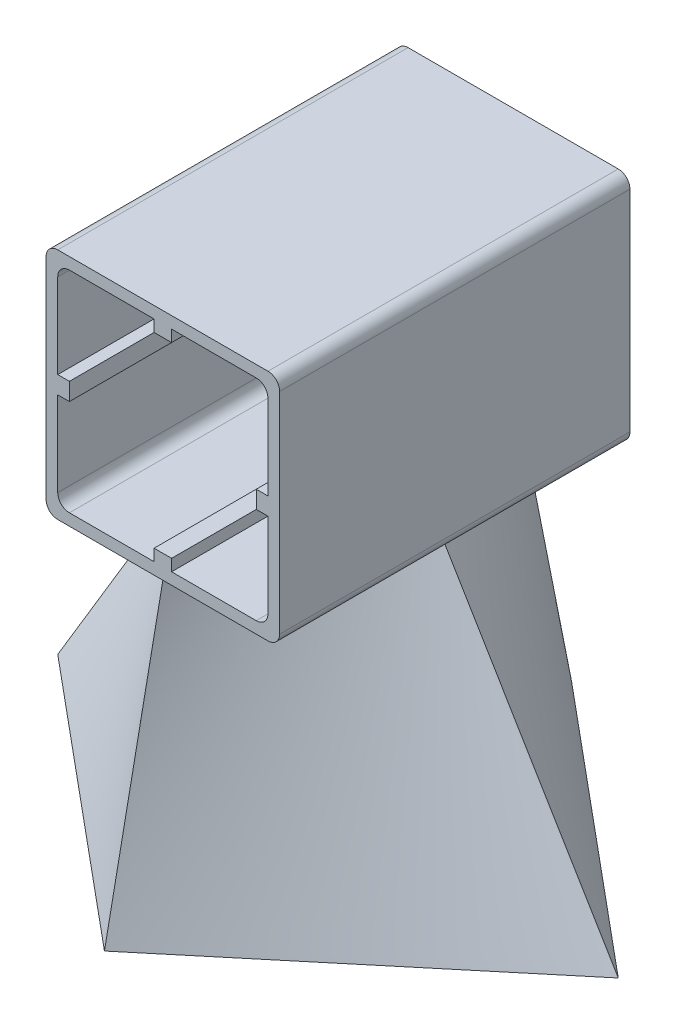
ISO-10303-21;
HEADER;
FILE_DESCRIPTION(('STEP AP214'),'2;1');
FILE_NAME('part.step','',(''),(''),'','','');
FILE_SCHEMA(('AUTOMOTIVE_DESIGN { 1 0 10303 214 1 1 1 1 }'));
ENDSEC;
DATA;
#1=APPLICATION_CONTEXT('core data for automotive mechanical design processes');
#2=APPLICATION_PROTOCOL_DEFINITION('international standard','automotive_design',2000,#1);
#3=PRODUCT_CONTEXT('',#1,'mechanical');
#4=PRODUCT('Part','Part','',(#3));
#5=PRODUCT_RELATED_PRODUCT_CATEGORY('part','',(#4));
#6=PRODUCT_DEFINITION_FORMATION('','',#4);
#7=PRODUCT_DEFINITION_CONTEXT('part definition',#1,'design');
#8=PRODUCT_DEFINITION('design','',#6,#7);
#9=PRODUCT_DEFINITION_SHAPE('','',#8);
#10=(LENGTH_UNIT() NAMED_UNIT(*) SI_UNIT(.MILLI.,.METRE.));
#11=(NAMED_UNIT(*) PLANE_ANGLE_UNIT() SI_UNIT($,.RADIAN.));
#12=(NAMED_UNIT(*) SI_UNIT($,.STERADIAN.) SOLID_ANGLE_UNIT());
#13=UNCERTAINTY_MEASURE_WITH_UNIT(LENGTH_MEASURE(1.E-05),#10,'distance_accuracy_value','');
#14=(GEOMETRIC_REPRESENTATION_CONTEXT(3) GLOBAL_UNCERTAINTY_ASSIGNED_CONTEXT((#13)) GLOBAL_UNIT_ASSIGNED_CONTEXT((#10,
#11,#12)) REPRESENTATION_CONTEXT('',''));
#15=CARTESIAN_POINT('',(0.,0.,0.));
#16=DIRECTION('',(0.,0.,1.));
#17=DIRECTION('',(1.,0.,0.));
#18=AXIS2_PLACEMENT_3D('',#15,#16,#17);
#19=CARTESIAN_POINT('',(0.,-10.,15.));
#20=DIRECTION('',(0.,-1.,0.));
#21=DIRECTION('',(0.,0.,-1.));
#22=AXIS2_PLACEMENT_3D('',#19,#20,#21);
#23=PLANE('',#22);
#24=DIRECTION('',(0.,0.,-1.));
#25=VECTOR('',#24,1.);
#26=CARTESIAN_POINT('',(-9.,-10.,15.));
#27=LINE('',#26,#25);
#28=CARTESIAN_POINT('',(-9.,-10.,15.));
#29=VERTEX_POINT('',#28);
#30=CARTESIAN_POINT('',(-9.,-10.,0.));
#31=VERTEX_POINT('',#30);
#32=EDGE_CURVE('E12',#29,#31,#27,.T.);
#33=ORIENTED_EDGE('',*,*,#32,.T.);
#34=DIRECTION('',(-0.514495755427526,0.,-0.857492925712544));
#35=VECTOR('',#34,1.);
#36=CARTESIAN_POINT('',(0.,-10.,15.));
#37=LINE('',#36,#35);
#38=CARTESIAN_POINT('',(0.,-10.,15.));
#39=VERTEX_POINT('',#38);
#40=EDGE_CURVE('E434',#39,#31,#37,.T.);
#41=ORIENTED_EDGE('',*,*,#40,.F.);
#42=DIRECTION('',(-1.,0.,0.));
#43=VECTOR('',#42,1.);
#44=CARTESIAN_POINT('',(0.,-10.,15.));
#45=LINE('',#44,#43);
#46=EDGE_CURVE('E318',#39,#29,#45,.T.);
#47=ORIENTED_EDGE('',*,*,#46,.T.);
#48=EDGE_LOOP('',(#33,#41,#47));
#49=FACE_BOUND('',#48,.T.);
#50=ADVANCED_FACE('F44',(#49),#23,.T.);
#51=CARTESIAN_POINT('',(9.,-10.,15.));
#52=VERTEX_POINT('',#51);
#53=EDGE_CURVE('E321',#52,#39,#45,.T.);
#54=ORIENTED_EDGE('',*,*,#53,.T.);
#55=DIRECTION('',(-0.514495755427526,0.,0.857492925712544));
#56=VECTOR('',#55,1.);
#57=CARTESIAN_POINT('',(9.,-10.,0.));
#58=LINE('',#57,#56);
#59=CARTESIAN_POINT('',(9.,-10.,0.));
#60=VERTEX_POINT('',#59);
#61=EDGE_CURVE('E342',#60,#39,#58,.T.);
#62=ORIENTED_EDGE('',*,*,#61,.F.);
#63=DIRECTION('',(0.,0.,-1.));
#64=VECTOR('',#63,1.);
#65=CARTESIAN_POINT('',(9.,-10.,15.));
#66=LINE('',#65,#64);
#67=EDGE_CURVE('E315',#52,#60,#66,.T.);
#68=ORIENTED_EDGE('',*,*,#67,.F.);
#69=EDGE_LOOP('',(#54,#62,#68));
#70=FACE_BOUND('',#69,.T.);
#71=ADVANCED_FACE('F443',(#70),#23,.T.);
#72=CARTESIAN_POINT('',(9.,-10.,-15.));
#73=VERTEX_POINT('',#72);
#74=EDGE_CURVE('E306',#60,#73,#66,.T.);
#75=ORIENTED_EDGE('',*,*,#74,.F.);
#76=DIRECTION('',(0.514495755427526,0.,0.857492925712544));
#77=VECTOR('',#76,1.);
#78=CARTESIAN_POINT('',(0.,-10.,-15.));
#79=LINE('',#78,#77);
#80=CARTESIAN_POINT('',(0.,-10.,-15.));
#81=VERTEX_POINT('',#80);
#82=EDGE_CURVE('E454',#81,#60,#79,.T.);
#83=ORIENTED_EDGE('',*,*,#82,.F.);
#84=DIRECTION('',(-1.,0.,0.));
#85=VECTOR('',#84,1.);
#86=CARTESIAN_POINT('',(0.,-10.,-15.));
#87=LINE('',#86,#85);
#88=EDGE_CURVE('E417',#73,#81,#87,.T.);
#89=ORIENTED_EDGE('',*,*,#88,.F.);
#90=EDGE_LOOP('',(#75,#83,#89));
#91=FACE_BOUND('',#90,.T.);
#92=ADVANCED_FACE('F769',(#91),#23,.T.);
#93=CARTESIAN_POINT('',(-9.,-10.,-15.));
#94=VERTEX_POINT('',#93);
#95=EDGE_CURVE('E409',#81,#94,#87,.T.);
#96=ORIENTED_EDGE('',*,*,#95,.F.);
#97=DIRECTION('',(0.514495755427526,0.,-0.857492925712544));
#98=VECTOR('',#97,1.);
#99=CARTESIAN_POINT('',(-9.,-10.,0.));
#100=LINE('',#99,#98);
#101=EDGE_CURVE('E1174',#31,#81,#100,.T.);
#102=ORIENTED_EDGE('',*,*,#101,.F.);
#103=EDGE_CURVE('E53',#31,#94,#27,.T.);
#104=ORIENTED_EDGE('',*,*,#103,.T.);
#105=EDGE_LOOP('',(#96,#102,#104));
#106=FACE_BOUND('',#105,.T.);
#107=ADVANCED_FACE('F765',(#106),#23,.T.);
#108=CARTESIAN_POINT('',(-9.,-9.,15.));
#109=DIRECTION('',(0.,0.,-1.));
#110=DIRECTION('',(-1.,0.,0.));
#111=AXIS2_PLACEMENT_3D('',#108,#109,#110);
#112=CYLINDRICAL_SURFACE('',#111,1.);
#113=CARTESIAN_POINT('',(-9.,-9.,-15.));
#114=DIRECTION('',(0.,0.,1.));
#115=DIRECTION('',(1.,0.,0.));
#116=AXIS2_PLACEMENT_3D('',#113,#114,#115);
#117=CIRCLE('',#116,1.);
#118=CARTESIAN_POINT('',(-10.,-9.,-15.));
#119=VERTEX_POINT('',#118);
#120=EDGE_CURVE('E406',#94,#119,#117,.F.);
#121=ORIENTED_EDGE('',*,*,#120,.F.);
#122=ORIENTED_EDGE('',*,*,#103,.F.);
#123=ORIENTED_EDGE('',*,*,#32,.F.);
#124=CARTESIAN_POINT('',(-9.,-9.,15.));
#125=DIRECTION('',(0.,0.,1.));
#126=DIRECTION('',(1.,0.,0.));
#127=AXIS2_PLACEMENT_3D('',#124,#125,#126);
#128=CIRCLE('',#127,1.);
#129=CARTESIAN_POINT('',(-10.,-9.,15.));
#130=VERTEX_POINT('',#129);
#131=EDGE_CURVE('E322',#29,#130,#128,.F.);
#132=ORIENTED_EDGE('',*,*,#131,.T.);
#133=DIRECTION('',(0.,0.,-1.));
#134=VECTOR('',#133,1.);
#135=CARTESIAN_POINT('',(-10.,-9.,15.));
#136=LINE('',#135,#134);
#137=EDGE_CURVE('E175',#130,#119,#136,.T.);
#138=ORIENTED_EDGE('',*,*,#137,.T.);
#139=EDGE_LOOP('',(#121,#122,#123,#132,#138));
#140=FACE_BOUND('',#139,.T.);
#141=ADVANCED_FACE('F430',(#140),#112,.T.);
#142=CARTESIAN_POINT('',(9.,-9.,15.));
#143=DIRECTION('',(0.,0.,-1.));
#144=DIRECTION('',(-1.,0.,0.));
#145=AXIS2_PLACEMENT_3D('',#142,#143,#144);
#146=CYLINDRICAL_SURFACE('',#145,1.);
#147=CARTESIAN_POINT('',(9.,-9.,-15.));
#148=DIRECTION('',(0.,0.,1.));
#149=DIRECTION('',(1.,0.,0.));
#150=AXIS2_PLACEMENT_3D('',#147,#148,#149);
#151=CIRCLE('',#150,1.);
#152=CARTESIAN_POINT('',(10.,-9.,-15.));
#153=VERTEX_POINT('',#152);
#154=EDGE_CURVE('E412',#153,#73,#151,.F.);
#155=ORIENTED_EDGE('',*,*,#154,.F.);
#156=DIRECTION('',(0.,0.,-1.));
#157=VECTOR('',#156,1.);
#158=CARTESIAN_POINT('',(10.,-9.,15.));
#159=LINE('',#158,#157);
#160=CARTESIAN_POINT('',(10.,-9.,15.));
#161=VERTEX_POINT('',#160);
#162=EDGE_CURVE('E304',#161,#153,#159,.T.);
#163=ORIENTED_EDGE('',*,*,#162,.F.);
#164=CARTESIAN_POINT('',(9.,-9.,15.));
#165=DIRECTION('',(0.,0.,1.));
#166=DIRECTION('',(1.,0.,0.));
#167=AXIS2_PLACEMENT_3D('',#164,#165,#166);
#168=CIRCLE('',#167,1.);
#169=EDGE_CURVE('E328',#161,#52,#168,.F.);
#170=ORIENTED_EDGE('',*,*,#169,.T.);
#171=ORIENTED_EDGE('',*,*,#67,.T.);
#172=ORIENTED_EDGE('',*,*,#74,.T.);
#173=EDGE_LOOP('',(#155,#163,#170,#171,#172));
#174=FACE_BOUND('',#173,.T.);
#175=ADVANCED_FACE('F448',(#174),#146,.T.);
#176=CARTESIAN_POINT('',(10.,0.,15.));
#177=DIRECTION('',(1.,0.,0.));
#178=DIRECTION('',(0.,0.,-1.));
#179=AXIS2_PLACEMENT_3D('',#176,#177,#178);
#180=PLANE('',#179);
#181=DIRECTION('',(0.,-1.,0.));
#182=VECTOR('',#181,1.);
#183=CARTESIAN_POINT('',(10.,0.,-15.));
#184=LINE('',#183,#182);
#185=CARTESIAN_POINT('',(10.,9.,-15.));
#186=VERTEX_POINT('',#185);
#187=EDGE_CURVE('E424',#186,#153,#184,.T.);
#188=ORIENTED_EDGE('',*,*,#187,.F.);
#189=DIRECTION('',(0.,0.,-1.));
#190=VECTOR('',#189,1.);
#191=CARTESIAN_POINT('',(10.,9.,15.));
#192=LINE('',#191,#190);
#193=CARTESIAN_POINT('',(10.,9.,15.));
#194=VERTEX_POINT('',#193);
#195=EDGE_CURVE('E298',#194,#186,#192,.T.);
#196=ORIENTED_EDGE('',*,*,#195,.F.);
#197=DIRECTION('',(0.,-1.,0.));
#198=VECTOR('',#197,1.);
#199=CARTESIAN_POINT('',(10.,0.,15.));
#200=LINE('',#199,#198);
#201=EDGE_CURVE('E332',#194,#161,#200,.T.);
#202=ORIENTED_EDGE('',*,*,#201,.T.);
#203=ORIENTED_EDGE('',*,*,#162,.T.);
#204=EDGE_LOOP('',(#188,#196,#202,#203));
#205=FACE_BOUND('',#204,.T.);
#206=ADVANCED_FACE('F784',(#205),#180,.T.);
#207=CARTESIAN_POINT('',(9.,9.,15.));
#208=DIRECTION('',(0.,0.,-1.));
#209=DIRECTION('',(-1.,0.,0.));
#210=AXIS2_PLACEMENT_3D('',#207,#208,#209);
#211=CYLINDRICAL_SURFACE('',#210,1.);
#212=CARTESIAN_POINT('',(9.,9.,-15.));
#213=DIRECTION('',(0.,0.,1.));
#214=DIRECTION('',(1.,0.,0.));
#215=AXIS2_PLACEMENT_3D('',#212,#213,#214);
#216=CIRCLE('',#215,1.);
#217=CARTESIAN_POINT('',(9.,10.,-15.));
#218=VERTEX_POINT('',#217);
#219=EDGE_CURVE('E788',#218,#186,#216,.F.);
#220=ORIENTED_EDGE('',*,*,#219,.F.);
#221=DIRECTION('',(0.,0.,-1.));
#222=VECTOR('',#221,1.);
#223=CARTESIAN_POINT('',(9.,10.,15.));
#224=LINE('',#223,#222);
#225=CARTESIAN_POINT('',(9.,10.,15.));
#226=VERTEX_POINT('',#225);
#227=EDGE_CURVE('E296',#226,#218,#224,.T.);
#228=ORIENTED_EDGE('',*,*,#227,.F.);
#229=CARTESIAN_POINT('',(9.,9.,15.));
#230=DIRECTION('',(0.,0.,1.));
#231=DIRECTION('',(1.,0.,0.));
#232=AXIS2_PLACEMENT_3D('',#229,#230,#231);
#233=CIRCLE('',#232,1.);
#234=EDGE_CURVE('E290',#226,#194,#233,.F.);
#235=ORIENTED_EDGE('',*,*,#234,.T.);
#236=ORIENTED_EDGE('',*,*,#195,.T.);
#237=EDGE_LOOP('',(#220,#228,#235,#236));
#238=FACE_BOUND('',#237,.T.);
#239=ADVANCED_FACE('F787',(#238),#211,.T.);
#240=CARTESIAN_POINT('',(0.,10.,15.));
#241=DIRECTION('',(0.,-1.,0.));
#242=DIRECTION('',(0.,0.,-1.));
#243=AXIS2_PLACEMENT_3D('',#240,#241,#242);
#244=PLANE('',#243);
#245=DIRECTION('',(-1.,0.,0.));
#246=VECTOR('',#245,1.);
#247=CARTESIAN_POINT('',(0.,10.,-15.));
#248=LINE('',#247,#246);
#249=CARTESIAN_POINT('',(-9.,10.,-15.));
#250=VERTEX_POINT('',#249);
#251=EDGE_CURVE('E295',#218,#250,#248,.T.);
#252=ORIENTED_EDGE('',*,*,#251,.T.);
#253=DIRECTION('',(0.,0.,-1.));
#254=VECTOR('',#253,1.);
#255=CARTESIAN_POINT('',(-9.,10.,15.));
#256=LINE('',#255,#254);
#257=CARTESIAN_POINT('',(-9.,10.,15.));
#258=VERTEX_POINT('',#257);
#259=EDGE_CURVE('E279',#258,#250,#256,.T.);
#260=ORIENTED_EDGE('',*,*,#259,.F.);
#261=DIRECTION('',(-1.,0.,0.));
#262=VECTOR('',#261,1.);
#263=CARTESIAN_POINT('',(0.,10.,15.));
#264=LINE('',#263,#262);
#265=EDGE_CURVE('E283',#226,#258,#264,.T.);
#266=ORIENTED_EDGE('',*,*,#265,.F.);
#267=ORIENTED_EDGE('',*,*,#227,.T.);
#268=EDGE_LOOP('',(#252,#260,#266,#267));
#269=FACE_BOUND('',#268,.T.);
#270=ADVANCED_FACE('F293',(#269),#244,.F.);
#271=CARTESIAN_POINT('',(-9.,9.,15.));
#272=DIRECTION('',(0.,0.,-1.));
#273=DIRECTION('',(-1.,0.,0.));
#274=AXIS2_PLACEMENT_3D('',#271,#272,#273);
#275=CYLINDRICAL_SURFACE('',#274,1.);
#276=CARTESIAN_POINT('',(-9.,9.,-15.));
#277=DIRECTION('',(0.,0.,1.));
#278=DIRECTION('',(1.,0.,0.));
#279=AXIS2_PLACEMENT_3D('',#276,#277,#278);
#280=CIRCLE('',#279,1.);
#281=CARTESIAN_POINT('',(-10.,9.,-15.));
#282=VERTEX_POINT('',#281);
#283=EDGE_CURVE('E789',#250,#282,#280,.T.);
#284=ORIENTED_EDGE('',*,*,#283,.T.);
#285=DIRECTION('',(0.,0.,-1.));
#286=VECTOR('',#285,1.);
#287=CARTESIAN_POINT('',(-10.,9.,15.));
#288=LINE('',#287,#286);
#289=CARTESIAN_POINT('',(-10.,9.,15.));
#290=VERTEX_POINT('',#289);
#291=EDGE_CURVE('E282',#290,#282,#288,.T.);
#292=ORIENTED_EDGE('',*,*,#291,.F.);
#293=CARTESIAN_POINT('',(-9.,9.,15.));
#294=DIRECTION('',(0.,0.,1.));
#295=DIRECTION('',(1.,0.,0.));
#296=AXIS2_PLACEMENT_3D('',#293,#294,#295);
#297=CIRCLE('',#296,1.);
#298=EDGE_CURVE('E274',#258,#290,#297,.T.);
#299=ORIENTED_EDGE('',*,*,#298,.F.);
#300=ORIENTED_EDGE('',*,*,#259,.T.);
#301=EDGE_LOOP('',(#284,#292,#299,#300));
#302=FACE_BOUND('',#301,.T.);
#303=ADVANCED_FACE('F277',(#302),#275,.T.);
#304=CARTESIAN_POINT('',(0.,-9.00000000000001,15.));
#305=DIRECTION('',(0.,-1.,0.));
#306=DIRECTION('',(0.,0.,-1.));
#307=AXIS2_PLACEMENT_3D('',#304,#305,#306);
#308=PLANE('',#307);
#309=DIRECTION('',(-1.,0.,0.));
#310=VECTOR('',#309,1.);
#311=CARTESIAN_POINT('',(0.,-9.00000000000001,-15.));
#312=LINE('',#311,#310);
#313=CARTESIAN_POINT('',(8.,-9.00000000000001,-15.));
#314=VERTEX_POINT('',#313);
#315=CARTESIAN_POINT('',(0.750000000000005,-9.00000000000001,-15.));
#316=VERTEX_POINT('',#315);
#317=EDGE_CURVE('E338',#314,#316,#312,.T.);
#318=ORIENTED_EDGE('',*,*,#317,.T.);
#319=DIRECTION('',(0.,0.,-1.));
#320=VECTOR('',#319,1.);
#321=CARTESIAN_POINT('',(0.750000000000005,-9.00000000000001,15.));
#322=LINE('',#321,#320);
#323=CARTESIAN_POINT('',(0.750000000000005,-9.00000000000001,15.));
#324=VERTEX_POINT('',#323);
#325=EDGE_CURVE('E617',#324,#316,#322,.T.);
#326=ORIENTED_EDGE('',*,*,#325,.F.);
#327=DIRECTION('',(-1.,0.,0.));
#328=VECTOR('',#327,1.);
#329=CARTESIAN_POINT('',(0.,-9.00000000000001,15.));
#330=LINE('',#329,#328);
#331=CARTESIAN_POINT('',(8.,-9.00000000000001,15.));
#332=VERTEX_POINT('',#331);
#333=EDGE_CURVE('E537',#332,#324,#330,.T.);
#334=ORIENTED_EDGE('',*,*,#333,.F.);
#335=DIRECTION('',(0.,0.,-1.));
#336=VECTOR('',#335,1.);
#337=CARTESIAN_POINT('',(8.,-9.00000000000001,15.));
#338=LINE('',#337,#336);
#339=EDGE_CURVE('E337',#332,#314,#338,.T.);
#340=ORIENTED_EDGE('',*,*,#339,.T.);
#341=EDGE_LOOP('',(#318,#326,#334,#340));
#342=FACE_BOUND('',#341,.T.);
#343=ADVANCED_FACE('F46',(#342),#308,.F.);
#344=CARTESIAN_POINT('',(0.750000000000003,0.,15.));
#345=DIRECTION('',(-1.,0.,0.));
#346=DIRECTION('',(0.,-1.,0.));
#347=AXIS2_PLACEMENT_3D('',#344,#345,#346);
#348=PLANE('',#347);
#349=DIRECTION('',(0.,1.,0.));
#350=VECTOR('',#349,1.);
#351=CARTESIAN_POINT('',(0.750000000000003,0.,-15.));
#352=LINE('',#351,#350);
#353=CARTESIAN_POINT('',(0.750000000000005,-8.,-15.));
#354=VERTEX_POINT('',#353);
#355=EDGE_CURVE('E341',#316,#354,#352,.T.);
#356=ORIENTED_EDGE('',*,*,#355,.T.);
#357=DIRECTION('',(0.,0.,-1.));
#358=VECTOR('',#357,1.);
#359=CARTESIAN_POINT('',(0.750000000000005,-8.,15.));
#360=LINE('',#359,#358);
#361=CARTESIAN_POINT('',(0.750000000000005,-8.,15.));
#362=VERTEX_POINT('',#361);
#363=EDGE_CURVE('E618',#362,#354,#360,.T.);
#364=ORIENTED_EDGE('',*,*,#363,.F.);
#365=DIRECTION('',(0.,1.,0.));
#366=VECTOR('',#365,1.);
#367=CARTESIAN_POINT('',(0.750000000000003,0.,15.));
#368=LINE('',#367,#366);
#369=EDGE_CURVE('E184',#324,#362,#368,.T.);
#370=ORIENTED_EDGE('',*,*,#369,.F.);
#371=ORIENTED_EDGE('',*,*,#325,.T.);
#372=EDGE_LOOP('',(#356,#364,#370,#371));
#373=FACE_BOUND('',#372,.T.);
#374=ADVANCED_FACE('F669',(#373),#348,.F.);
#375=CARTESIAN_POINT('',(0.,-8.,15.));
#376=DIRECTION('',(0.,1.,0.));
#377=DIRECTION('',(0.,0.,1.));
#378=AXIS2_PLACEMENT_3D('',#375,#376,#377);
#379=PLANE('',#378);
#380=DIRECTION('',(1.,0.,0.));
#381=VECTOR('',#380,1.);
#382=CARTESIAN_POINT('',(0.,-8.,-15.));
#383=LINE('',#382,#381);
#384=CARTESIAN_POINT('',(-0.749999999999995,-8.,-15.));
#385=VERTEX_POINT('',#384);
#386=EDGE_CURVE('E345',#385,#354,#383,.T.);
#387=ORIENTED_EDGE('',*,*,#386,.F.);
#388=DIRECTION('',(0.,0.,-1.));
#389=VECTOR('',#388,1.);
#390=CARTESIAN_POINT('',(-0.749999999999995,-8.,15.));
#391=LINE('',#390,#389);
#392=CARTESIAN_POINT('',(-0.749999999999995,-8.,15.));
#393=VERTEX_POINT('',#392);
#394=EDGE_CURVE('E619',#393,#385,#391,.T.);
#395=ORIENTED_EDGE('',*,*,#394,.F.);
#396=DIRECTION('',(1.,0.,0.));
#397=VECTOR('',#396,1.);
#398=CARTESIAN_POINT('',(0.,-8.,15.));
#399=LINE('',#398,#397);
#400=EDGE_CURVE('E546',#393,#362,#399,.T.);
#401=ORIENTED_EDGE('',*,*,#400,.T.);
#402=ORIENTED_EDGE('',*,*,#363,.T.);
#403=EDGE_LOOP('',(#387,#395,#401,#402));
#404=FACE_BOUND('',#403,.T.);
#405=ADVANCED_FACE('F672',(#404),#379,.T.);
#406=CARTESIAN_POINT('',(-0.749999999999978,0.,15.));
#407=DIRECTION('',(-1.,0.,0.));
#408=DIRECTION('',(0.,-1.,0.));
#409=AXIS2_PLACEMENT_3D('',#406,#407,#408);
#410=PLANE('',#409);
#411=DIRECTION('',(0.,1.,0.));
#412=VECTOR('',#411,1.);
#413=CARTESIAN_POINT('',(-0.749999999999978,0.,-15.));
#414=LINE('',#413,#412);
#415=CARTESIAN_POINT('',(-0.749999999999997,-9.00000000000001,-15.));
#416=VERTEX_POINT('',#415);
#417=EDGE_CURVE('E348',#416,#385,#414,.T.);
#418=ORIENTED_EDGE('',*,*,#417,.F.);
#419=DIRECTION('',(0.,0.,-1.));
#420=VECTOR('',#419,1.);
#421=CARTESIAN_POINT('',(-0.749999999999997,-9.00000000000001,15.));
#422=LINE('',#421,#420);
#423=CARTESIAN_POINT('',(-0.749999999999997,-9.00000000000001,15.));
#424=VERTEX_POINT('',#423);
#425=EDGE_CURVE('E623',#424,#416,#422,.T.);
#426=ORIENTED_EDGE('',*,*,#425,.F.);
#427=DIRECTION('',(0.,1.,0.));
#428=VECTOR('',#427,1.);
#429=CARTESIAN_POINT('',(-0.749999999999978,0.,15.));
#430=LINE('',#429,#428);
#431=EDGE_CURVE('E549',#424,#393,#430,.T.);
#432=ORIENTED_EDGE('',*,*,#431,.T.);
#433=ORIENTED_EDGE('',*,*,#394,.T.);
#434=EDGE_LOOP('',(#418,#426,#432,#433));
#435=FACE_BOUND('',#434,.T.);
#436=ADVANCED_FACE('F676',(#435),#410,.T.);
#437=CARTESIAN_POINT('',(0.,-9.00000000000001,15.));
#438=DIRECTION('',(0.,-1.,0.));
#439=DIRECTION('',(0.,0.,-1.));
#440=AXIS2_PLACEMENT_3D('',#437,#438,#439);
#441=PLANE('',#440);
#442=DIRECTION('',(-1.,0.,0.));
#443=VECTOR('',#442,1.);
#444=CARTESIAN_POINT('',(0.,-9.00000000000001,-15.));
#445=LINE('',#444,#443);
#446=CARTESIAN_POINT('',(-8.,-9.00000000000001,-15.));
#447=VERTEX_POINT('',#446);
#448=EDGE_CURVE('E351',#416,#447,#445,.T.);
#449=ORIENTED_EDGE('',*,*,#448,.T.);
#450=DIRECTION('',(0.,0.,-1.));
#451=VECTOR('',#450,1.);
#452=CARTESIAN_POINT('',(-8.,-9.00000000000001,15.));
#453=LINE('',#452,#451);
#454=CARTESIAN_POINT('',(-8.,-9.00000000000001,15.));
#455=VERTEX_POINT('',#454);
#456=EDGE_CURVE('E625',#455,#447,#453,.T.);
#457=ORIENTED_EDGE('',*,*,#456,.F.);
#458=DIRECTION('',(-1.,0.,0.));
#459=VECTOR('',#458,1.);
#460=CARTESIAN_POINT('',(0.,-9.00000000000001,15.));
#461=LINE('',#460,#459);
#462=EDGE_CURVE('E552',#424,#455,#461,.T.);
#463=ORIENTED_EDGE('',*,*,#462,.F.);
#464=ORIENTED_EDGE('',*,*,#425,.T.);
#465=EDGE_LOOP('',(#449,#457,#463,#464));
#466=FACE_BOUND('',#465,.T.);
#467=ADVANCED_FACE('F681',(#466),#441,.F.);
#468=CARTESIAN_POINT('',(-8.,-8.,15.));
#469=DIRECTION('',(0.,0.,-1.));
#470=DIRECTION('',(-1.,0.,0.));
#471=AXIS2_PLACEMENT_3D('',#468,#469,#470);
#472=CYLINDRICAL_SURFACE('',#471,1.);
#473=CARTESIAN_POINT('',(-8.,-8.,-15.));
#474=DIRECTION('',(0.,0.,1.));
#475=DIRECTION('',(1.,0.,0.));
#476=AXIS2_PLACEMENT_3D('',#473,#474,#475);
#477=CIRCLE('',#476,1.);
#478=CARTESIAN_POINT('',(-9.,-8.,-15.));
#479=VERTEX_POINT('',#478);
#480=EDGE_CURVE('E353',#447,#479,#477,.F.);
#481=ORIENTED_EDGE('',*,*,#480,.T.);
#482=DIRECTION('',(0.,0.,-1.));
#483=VECTOR('',#482,1.);
#484=CARTESIAN_POINT('',(-9.,-8.,15.));
#485=LINE('',#484,#483);
#486=CARTESIAN_POINT('',(-9.,-8.,15.));
#487=VERTEX_POINT('',#486);
#488=EDGE_CURVE('E628',#487,#479,#485,.T.);
#489=ORIENTED_EDGE('',*,*,#488,.F.);
#490=CARTESIAN_POINT('',(-8.,-8.,15.));
#491=DIRECTION('',(0.,0.,1.));
#492=DIRECTION('',(1.,0.,0.));
#493=AXIS2_PLACEMENT_3D('',#490,#491,#492);
#494=CIRCLE('',#493,1.);
#495=EDGE_CURVE('E554',#455,#487,#494,.F.);
#496=ORIENTED_EDGE('',*,*,#495,.F.);
#497=ORIENTED_EDGE('',*,*,#456,.T.);
#498=EDGE_LOOP('',(#481,#489,#496,#497));
#499=FACE_BOUND('',#498,.T.);
#500=ADVANCED_FACE('F686',(#499),#472,.F.);
#501=CARTESIAN_POINT('',(-9.,0.,15.));
#502=DIRECTION('',(1.,0.,0.));
#503=DIRECTION('',(0.,0.,-1.));
#504=AXIS2_PLACEMENT_3D('',#501,#502,#503);
#505=PLANE('',#504);
#506=DIRECTION('',(0.,-1.,0.));
#507=VECTOR('',#506,1.);
#508=CARTESIAN_POINT('',(-9.,0.,-15.));
#509=LINE('',#508,#507);
#510=CARTESIAN_POINT('',(-9.,-0.749999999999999,-15.));
#511=VERTEX_POINT('',#510);
#512=EDGE_CURVE('E356',#511,#479,#509,.T.);
#513=ORIENTED_EDGE('',*,*,#512,.F.);
#514=DIRECTION('',(0.,0.,-1.));
#515=VECTOR('',#514,1.);
#516=CARTESIAN_POINT('',(-9.,-0.749999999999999,15.));
#517=LINE('',#516,#515);
#518=CARTESIAN_POINT('',(-9.,-0.749999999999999,15.));
#519=VERTEX_POINT('',#518);
#520=EDGE_CURVE('E630',#519,#511,#517,.T.);
#521=ORIENTED_EDGE('',*,*,#520,.F.);
#522=DIRECTION('',(0.,-1.,0.));
#523=VECTOR('',#522,1.);
#524=CARTESIAN_POINT('',(-9.,0.,15.));
#525=LINE('',#524,#523);
#526=EDGE_CURVE('E556',#519,#487,#525,.T.);
#527=ORIENTED_EDGE('',*,*,#526,.T.);
#528=ORIENTED_EDGE('',*,*,#488,.T.);
#529=EDGE_LOOP('',(#513,#521,#527,#528));
#530=FACE_BOUND('',#529,.T.);
#531=ADVANCED_FACE('F690',(#530),#505,.T.);
#532=CARTESIAN_POINT('',(0.,-0.75000000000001,15.));
#533=DIRECTION('',(0.,1.,0.));
#534=DIRECTION('',(-1.,0.,0.));
#535=AXIS2_PLACEMENT_3D('',#532,#533,#534);
#536=PLANE('',#535);
#537=DIRECTION('',(1.,0.,0.));
#538=VECTOR('',#537,1.);
#539=CARTESIAN_POINT('',(0.,-0.75000000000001,-15.));
#540=LINE('',#539,#538);
#541=CARTESIAN_POINT('',(-8.,-0.75,-15.));
#542=VERTEX_POINT('',#541);
#543=EDGE_CURVE('E359',#511,#542,#540,.T.);
#544=ORIENTED_EDGE('',*,*,#543,.T.);
#545=DIRECTION('',(0.,0.,-1.));
#546=VECTOR('',#545,1.);
#547=CARTESIAN_POINT('',(-8.,-0.75,15.));
#548=LINE('',#547,#546);
#549=CARTESIAN_POINT('',(-8.,-0.75,15.));
#550=VERTEX_POINT('',#549);
#551=EDGE_CURVE('E632',#550,#542,#548,.T.);
#552=ORIENTED_EDGE('',*,*,#551,.F.);
#553=DIRECTION('',(1.,0.,0.));
#554=VECTOR('',#553,1.);
#555=CARTESIAN_POINT('',(0.,-0.75000000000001,15.));
#556=LINE('',#555,#554);
#557=EDGE_CURVE('E559',#519,#550,#556,.T.);
#558=ORIENTED_EDGE('',*,*,#557,.F.);
#559=ORIENTED_EDGE('',*,*,#520,.T.);
#560=EDGE_LOOP('',(#544,#552,#558,#559));
#561=FACE_BOUND('',#560,.T.);
#562=ADVANCED_FACE('F695',(#561),#536,.F.);
#563=CARTESIAN_POINT('',(-8.,0.,15.));
#564=DIRECTION('',(1.,0.,0.));
#565=DIRECTION('',(0.,0.,-1.));
#566=AXIS2_PLACEMENT_3D('',#563,#564,#565);
#567=PLANE('',#566);
#568=DIRECTION('',(0.,-1.,0.));
#569=VECTOR('',#568,1.);
#570=CARTESIAN_POINT('',(-8.,0.,-15.));
#571=LINE('',#570,#569);
#572=CARTESIAN_POINT('',(-8.,0.75,-15.));
#573=VERTEX_POINT('',#572);
#574=EDGE_CURVE('E362',#573,#542,#571,.T.);
#575=ORIENTED_EDGE('',*,*,#574,.F.);
#576=DIRECTION('',(0.,0.,-1.));
#577=VECTOR('',#576,1.);
#578=CARTESIAN_POINT('',(-8.,0.75,15.));
#579=LINE('',#578,#577);
#580=CARTESIAN_POINT('',(-8.,0.75,15.));
#581=VERTEX_POINT('',#580);
#582=EDGE_CURVE('E634',#581,#573,#579,.T.);
#583=ORIENTED_EDGE('',*,*,#582,.F.);
#584=DIRECTION('',(0.,-1.,0.));
#585=VECTOR('',#584,1.);
#586=CARTESIAN_POINT('',(-8.,0.,15.));
#587=LINE('',#586,#585);
#588=EDGE_CURVE('E561',#581,#550,#587,.T.);
#589=ORIENTED_EDGE('',*,*,#588,.T.);
#590=ORIENTED_EDGE('',*,*,#551,.T.);
#591=EDGE_LOOP('',(#575,#583,#589,#590));
#592=FACE_BOUND('',#591,.T.);
#593=ADVANCED_FACE('F878',(#592),#567,.T.);
#594=CARTESIAN_POINT('',(0.,0.750000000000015,15.));
#595=DIRECTION('',(0.,1.,0.));
#596=DIRECTION('',(-1.,0.,0.));
#597=AXIS2_PLACEMENT_3D('',#594,#595,#596);
#598=PLANE('',#597);
#599=DIRECTION('',(1.,0.,0.));
#600=VECTOR('',#599,1.);
#601=CARTESIAN_POINT('',(0.,0.750000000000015,-15.));
#602=LINE('',#601,#600);
#603=CARTESIAN_POINT('',(-9.,0.749999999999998,-15.));
#604=VERTEX_POINT('',#603);
#605=EDGE_CURVE('E365',#604,#573,#602,.T.);
#606=ORIENTED_EDGE('',*,*,#605,.F.);
#607=DIRECTION('',(0.,0.,-1.));
#608=VECTOR('',#607,1.);
#609=CARTESIAN_POINT('',(-9.,0.749999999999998,15.));
#610=LINE('',#609,#608);
#611=CARTESIAN_POINT('',(-9.,0.749999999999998,15.));
#612=VERTEX_POINT('',#611);
#613=EDGE_CURVE('E636',#612,#604,#610,.T.);
#614=ORIENTED_EDGE('',*,*,#613,.F.);
#615=DIRECTION('',(1.,0.,0.));
#616=VECTOR('',#615,1.);
#617=CARTESIAN_POINT('',(0.,0.750000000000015,15.));
#618=LINE('',#617,#616);
#619=EDGE_CURVE('E564',#612,#581,#618,.T.);
#620=ORIENTED_EDGE('',*,*,#619,.T.);
#621=ORIENTED_EDGE('',*,*,#582,.T.);
#622=EDGE_LOOP('',(#606,#614,#620,#621));
#623=FACE_BOUND('',#622,.T.);
#624=ADVANCED_FACE('F702',(#623),#598,.T.);
#625=CARTESIAN_POINT('',(-9.,0.,15.));
#626=DIRECTION('',(1.,0.,0.));
#627=DIRECTION('',(0.,0.,-1.));
#628=AXIS2_PLACEMENT_3D('',#625,#626,#627);
#629=PLANE('',#628);
#630=DIRECTION('',(0.,-1.,0.));
#631=VECTOR('',#630,1.);
#632=CARTESIAN_POINT('',(-9.,0.,-15.));
#633=LINE('',#632,#631);
#634=CARTESIAN_POINT('',(-9.,8.,-15.));
#635=VERTEX_POINT('',#634);
#636=EDGE_CURVE('E368',#635,#604,#633,.T.);
#637=ORIENTED_EDGE('',*,*,#636,.F.);
#638=DIRECTION('',(0.,0.,-1.));
#639=VECTOR('',#638,1.);
#640=CARTESIAN_POINT('',(-9.,8.,15.));
#641=LINE('',#640,#639);
#642=CARTESIAN_POINT('',(-9.,8.,15.));
#643=VERTEX_POINT('',#642);
#644=EDGE_CURVE('E638',#643,#635,#641,.T.);
#645=ORIENTED_EDGE('',*,*,#644,.F.);
#646=DIRECTION('',(0.,-1.,0.));
#647=VECTOR('',#646,1.);
#648=CARTESIAN_POINT('',(-9.,0.,15.));
#649=LINE('',#648,#647);
#650=EDGE_CURVE('E567',#643,#612,#649,.T.);
#651=ORIENTED_EDGE('',*,*,#650,.T.);
#652=ORIENTED_EDGE('',*,*,#613,.T.);
#653=EDGE_LOOP('',(#637,#645,#651,#652));
#654=FACE_BOUND('',#653,.T.);
#655=ADVANCED_FACE('F706',(#654),#629,.T.);
#656=CARTESIAN_POINT('',(-8.,8.,15.));
#657=DIRECTION('',(0.,0.,-1.));
#658=DIRECTION('',(-1.,0.,0.));
#659=AXIS2_PLACEMENT_3D('',#656,#657,#658);
#660=CYLINDRICAL_SURFACE('',#659,0.999999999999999);
#661=CARTESIAN_POINT('',(-8.,8.,-15.));
#662=DIRECTION('',(0.,0.,1.));
#663=DIRECTION('',(1.,0.,0.));
#664=AXIS2_PLACEMENT_3D('',#661,#662,#663);
#665=CIRCLE('',#664,0.999999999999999);
#666=CARTESIAN_POINT('',(-8.,9.,-15.));
#667=VERTEX_POINT('',#666);
#668=EDGE_CURVE('E371',#667,#635,#665,.T.);
#669=ORIENTED_EDGE('',*,*,#668,.F.);
#670=DIRECTION('',(0.,0.,-1.));
#671=VECTOR('',#670,1.);
#672=CARTESIAN_POINT('',(-8.,9.,15.));
#673=LINE('',#672,#671);
#674=CARTESIAN_POINT('',(-8.,9.,15.));
#675=VERTEX_POINT('',#674);
#676=EDGE_CURVE('E640',#675,#667,#673,.T.);
#677=ORIENTED_EDGE('',*,*,#676,.F.);
#678=CARTESIAN_POINT('',(-8.,8.,15.));
#679=DIRECTION('',(0.,0.,1.));
#680=DIRECTION('',(1.,0.,0.));
#681=AXIS2_PLACEMENT_3D('',#678,#679,#680);
#682=CIRCLE('',#681,0.999999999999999);
#683=EDGE_CURVE('E570',#675,#643,#682,.T.);
#684=ORIENTED_EDGE('',*,*,#683,.T.);
#685=ORIENTED_EDGE('',*,*,#644,.T.);
#686=EDGE_LOOP('',(#669,#677,#684,#685));
#687=FACE_BOUND('',#686,.T.);
#688=ADVANCED_FACE('F711',(#687),#660,.F.);
#689=CARTESIAN_POINT('',(0.,9.,15.));
#690=DIRECTION('',(0.,-1.,0.));
#691=DIRECTION('',(0.,0.,-1.));
#692=AXIS2_PLACEMENT_3D('',#689,#690,#691);
#693=PLANE('',#692);
#694=DIRECTION('',(-1.,0.,0.));
#695=VECTOR('',#694,1.);
#696=CARTESIAN_POINT('',(0.,9.,-15.));
#697=LINE('',#696,#695);
#698=CARTESIAN_POINT('',(-0.750000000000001,9.,-15.));
#699=VERTEX_POINT('',#698);
#700=EDGE_CURVE('E374',#699,#667,#697,.T.);
#701=ORIENTED_EDGE('',*,*,#700,.F.);
#702=DIRECTION('',(0.,0.,-1.));
#703=VECTOR('',#702,1.);
#704=CARTESIAN_POINT('',(-0.750000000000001,9.,15.));
#705=LINE('',#704,#703);
#706=CARTESIAN_POINT('',(-0.750000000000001,9.,15.));
#707=VERTEX_POINT('',#706);
#708=EDGE_CURVE('E642',#707,#699,#705,.T.);
#709=ORIENTED_EDGE('',*,*,#708,.F.);
#710=DIRECTION('',(-1.,0.,0.));
#711=VECTOR('',#710,1.);
#712=CARTESIAN_POINT('',(0.,9.,15.));
#713=LINE('',#712,#711);
#714=EDGE_CURVE('E573',#707,#675,#713,.T.);
#715=ORIENTED_EDGE('',*,*,#714,.T.);
#716=ORIENTED_EDGE('',*,*,#676,.T.);
#717=EDGE_LOOP('',(#701,#709,#715,#716));
#718=FACE_BOUND('',#717,.T.);
#719=ADVANCED_FACE('F714',(#718),#693,.T.);
#720=CARTESIAN_POINT('',(-0.750000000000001,0.,15.));
#721=DIRECTION('',(1.,0.,0.));
#722=DIRECTION('',(0.,0.,-1.));
#723=AXIS2_PLACEMENT_3D('',#720,#721,#722);
#724=PLANE('',#723);
#725=DIRECTION('',(0.,-1.,0.));
#726=VECTOR('',#725,1.);
#727=CARTESIAN_POINT('',(-0.750000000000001,0.,-15.));
#728=LINE('',#727,#726);
#729=CARTESIAN_POINT('',(-0.750000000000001,8.,-15.));
#730=VERTEX_POINT('',#729);
#731=EDGE_CURVE('E377',#699,#730,#728,.T.);
#732=ORIENTED_EDGE('',*,*,#731,.T.);
#733=DIRECTION('',(0.,0.,-1.));
#734=VECTOR('',#733,1.);
#735=CARTESIAN_POINT('',(-0.750000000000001,8.,15.));
#736=LINE('',#735,#734);
#737=CARTESIAN_POINT('',(-0.750000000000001,8.,15.));
#738=VERTEX_POINT('',#737);
#739=EDGE_CURVE('E644',#738,#730,#736,.T.);
#740=ORIENTED_EDGE('',*,*,#739,.F.);
#741=DIRECTION('',(0.,-1.,0.));
#742=VECTOR('',#741,1.);
#743=CARTESIAN_POINT('',(-0.750000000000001,0.,15.));
#744=LINE('',#743,#742);
#745=EDGE_CURVE('E576',#707,#738,#744,.T.);
#746=ORIENTED_EDGE('',*,*,#745,.F.);
#747=ORIENTED_EDGE('',*,*,#708,.T.);
#748=EDGE_LOOP('',(#732,#740,#746,#747));
#749=FACE_BOUND('',#748,.T.);
#750=ADVANCED_FACE('F720',(#749),#724,.F.);
#751=CARTESIAN_POINT('',(0.,8.,15.));
#752=DIRECTION('',(0.,-1.,0.));
#753=DIRECTION('',(0.,0.,-1.));
#754=AXIS2_PLACEMENT_3D('',#751,#752,#753);
#755=PLANE('',#754);
#756=DIRECTION('',(-1.,0.,0.));
#757=VECTOR('',#756,1.);
#758=CARTESIAN_POINT('',(0.,8.,-15.));
#759=LINE('',#758,#757);
#760=CARTESIAN_POINT('',(0.749999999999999,8.,-15.));
#761=VERTEX_POINT('',#760);
#762=EDGE_CURVE('E380',#761,#730,#759,.T.);
#763=ORIENTED_EDGE('',*,*,#762,.F.);
#764=DIRECTION('',(0.,0.,-1.));
#765=VECTOR('',#764,1.);
#766=CARTESIAN_POINT('',(0.749999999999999,8.,15.));
#767=LINE('',#766,#765);
#768=CARTESIAN_POINT('',(0.749999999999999,8.,15.));
#769=VERTEX_POINT('',#768);
#770=EDGE_CURVE('E646',#769,#761,#767,.T.);
#771=ORIENTED_EDGE('',*,*,#770,.F.);
#772=DIRECTION('',(-1.,0.,0.));
#773=VECTOR('',#772,1.);
#774=CARTESIAN_POINT('',(0.,8.,15.));
#775=LINE('',#774,#773);
#776=EDGE_CURVE('E578',#769,#738,#775,.T.);
#777=ORIENTED_EDGE('',*,*,#776,.T.);
#778=ORIENTED_EDGE('',*,*,#739,.T.);
#779=EDGE_LOOP('',(#763,#771,#777,#778));
#780=FACE_BOUND('',#779,.T.);
#781=ADVANCED_FACE('F724',(#780),#755,.T.);
#782=CARTESIAN_POINT('',(0.74999999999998,0.,15.));
#783=DIRECTION('',(1.,0.,0.));
#784=DIRECTION('',(0.,1.,0.));
#785=AXIS2_PLACEMENT_3D('',#782,#783,#784);
#786=PLANE('',#785);
#787=DIRECTION('',(0.,-1.,0.));
#788=VECTOR('',#787,1.);
#789=CARTESIAN_POINT('',(0.74999999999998,0.,-15.));
#790=LINE('',#789,#788);
#791=CARTESIAN_POINT('',(0.750000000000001,9.,-15.));
#792=VERTEX_POINT('',#791);
#793=EDGE_CURVE('E383',#792,#761,#790,.T.);
#794=ORIENTED_EDGE('',*,*,#793,.F.);
#795=DIRECTION('',(0.,0.,-1.));
#796=VECTOR('',#795,1.);
#797=CARTESIAN_POINT('',(0.750000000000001,9.,15.));
#798=LINE('',#797,#796);
#799=CARTESIAN_POINT('',(0.750000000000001,9.,15.));
#800=VERTEX_POINT('',#799);
#801=EDGE_CURVE('E648',#800,#792,#798,.T.);
#802=ORIENTED_EDGE('',*,*,#801,.F.);
#803=DIRECTION('',(0.,-1.,0.));
#804=VECTOR('',#803,1.);
#805=CARTESIAN_POINT('',(0.74999999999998,0.,15.));
#806=LINE('',#805,#804);
#807=EDGE_CURVE('E581',#800,#769,#806,.T.);
#808=ORIENTED_EDGE('',*,*,#807,.T.);
#809=ORIENTED_EDGE('',*,*,#770,.T.);
#810=EDGE_LOOP('',(#794,#802,#808,#809));
#811=FACE_BOUND('',#810,.T.);
#812=ADVANCED_FACE('F727',(#811),#786,.T.);
#813=CARTESIAN_POINT('',(0.,9.,15.));
#814=DIRECTION('',(0.,-1.,0.));
#815=DIRECTION('',(0.,0.,-1.));
#816=AXIS2_PLACEMENT_3D('',#813,#814,#815);
#817=PLANE('',#816);
#818=DIRECTION('',(-1.,0.,0.));
#819=VECTOR('',#818,1.);
#820=CARTESIAN_POINT('',(0.,9.,-15.));
#821=LINE('',#820,#819);
#822=CARTESIAN_POINT('',(8.,9.,-15.));
#823=VERTEX_POINT('',#822);
#824=EDGE_CURVE('E386',#823,#792,#821,.T.);
#825=ORIENTED_EDGE('',*,*,#824,.F.);
#826=DIRECTION('',(0.,0.,-1.));
#827=VECTOR('',#826,1.);
#828=CARTESIAN_POINT('',(8.,9.,15.));
#829=LINE('',#828,#827);
#830=CARTESIAN_POINT('',(8.,9.,15.));
#831=VERTEX_POINT('',#830);
#832=EDGE_CURVE('E650',#831,#823,#829,.T.);
#833=ORIENTED_EDGE('',*,*,#832,.F.);
#834=DIRECTION('',(-1.,0.,0.));
#835=VECTOR('',#834,1.);
#836=CARTESIAN_POINT('',(0.,9.,15.));
#837=LINE('',#836,#835);
#838=EDGE_CURVE('E584',#831,#800,#837,.T.);
#839=ORIENTED_EDGE('',*,*,#838,.T.);
#840=ORIENTED_EDGE('',*,*,#801,.T.);
#841=EDGE_LOOP('',(#825,#833,#839,#840));
#842=FACE_BOUND('',#841,.T.);
#843=ADVANCED_FACE('F731',(#842),#817,.T.);
#844=CARTESIAN_POINT('',(8.,8.,15.));
#845=DIRECTION('',(0.,0.,-1.));
#846=DIRECTION('',(-1.,0.,0.));
#847=AXIS2_PLACEMENT_3D('',#844,#845,#846);
#848=CYLINDRICAL_SURFACE('',#847,0.999999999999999);
#849=CARTESIAN_POINT('',(8.,8.,-15.));
#850=DIRECTION('',(0.,0.,1.));
#851=DIRECTION('',(1.,0.,0.));
#852=AXIS2_PLACEMENT_3D('',#849,#850,#851);
#853=CIRCLE('',#852,0.999999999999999);
#854=CARTESIAN_POINT('',(9.,8.,-15.));
#855=VERTEX_POINT('',#854);
#856=EDGE_CURVE('E389',#823,#855,#853,.F.);
#857=ORIENTED_EDGE('',*,*,#856,.T.);
#858=DIRECTION('',(0.,0.,-1.));
#859=VECTOR('',#858,1.);
#860=CARTESIAN_POINT('',(9.,8.,15.));
#861=LINE('',#860,#859);
#862=CARTESIAN_POINT('',(9.,8.,15.));
#863=VERTEX_POINT('',#862);
#864=EDGE_CURVE('E652',#863,#855,#861,.T.);
#865=ORIENTED_EDGE('',*,*,#864,.F.);
#866=CARTESIAN_POINT('',(8.,8.,15.));
#867=DIRECTION('',(0.,0.,1.));
#868=DIRECTION('',(1.,0.,0.));
#869=AXIS2_PLACEMENT_3D('',#866,#867,#868);
#870=CIRCLE('',#869,0.999999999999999);
#871=EDGE_CURVE('E587',#831,#863,#870,.F.);
#872=ORIENTED_EDGE('',*,*,#871,.F.);
#873=ORIENTED_EDGE('',*,*,#832,.T.);
#874=EDGE_LOOP('',(#857,#865,#872,#873));
#875=FACE_BOUND('',#874,.T.);
#876=ADVANCED_FACE('F736',(#875),#848,.F.);
#877=CARTESIAN_POINT('',(9.,0.,15.));
#878=DIRECTION('',(1.,0.,0.));
#879=DIRECTION('',(0.,0.,-1.));
#880=AXIS2_PLACEMENT_3D('',#877,#878,#879);
#881=PLANE('',#880);
#882=DIRECTION('',(0.,-1.,0.));
#883=VECTOR('',#882,1.);
#884=CARTESIAN_POINT('',(9.,0.,-15.));
#885=LINE('',#884,#883);
#886=CARTESIAN_POINT('',(9.,0.750000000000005,-15.));
#887=VERTEX_POINT('',#886);
#888=EDGE_CURVE('E391',#855,#887,#885,.T.);
#889=ORIENTED_EDGE('',*,*,#888,.T.);
#890=DIRECTION('',(0.,0.,-1.));
#891=VECTOR('',#890,1.);
#892=CARTESIAN_POINT('',(9.,0.750000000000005,15.));
#893=LINE('',#892,#891);
#894=CARTESIAN_POINT('',(9.,0.750000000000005,15.));
#895=VERTEX_POINT('',#894);
#896=EDGE_CURVE('E655',#895,#887,#893,.T.);
#897=ORIENTED_EDGE('',*,*,#896,.F.);
#898=DIRECTION('',(0.,-1.,0.));
#899=VECTOR('',#898,1.);
#900=CARTESIAN_POINT('',(9.,0.,15.));
#901=LINE('',#900,#899);
#902=EDGE_CURVE('E589',#863,#895,#901,.T.);
#903=ORIENTED_EDGE('',*,*,#902,.F.);
#904=ORIENTED_EDGE('',*,*,#864,.T.);
#905=EDGE_LOOP('',(#889,#897,#903,#904));
#906=FACE_BOUND('',#905,.T.);
#907=ADVANCED_FACE('F743',(#906),#881,.F.);
#908=CARTESIAN_POINT('',(0.,0.750000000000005,15.));
#909=DIRECTION('',(0.,-1.,0.));
#910=DIRECTION('',(0.,0.,-1.));
#911=AXIS2_PLACEMENT_3D('',#908,#909,#910);
#912=PLANE('',#911);
#913=DIRECTION('',(-1.,0.,0.));
#914=VECTOR('',#913,1.);
#915=CARTESIAN_POINT('',(0.,0.750000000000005,-15.));
#916=LINE('',#915,#914);
#917=CARTESIAN_POINT('',(8.,0.750000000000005,-15.));
#918=VERTEX_POINT('',#917);
#919=EDGE_CURVE('E393',#887,#918,#916,.T.);
#920=ORIENTED_EDGE('',*,*,#919,.T.);
#921=DIRECTION('',(0.,0.,-1.));
#922=VECTOR('',#921,1.);
#923=CARTESIAN_POINT('',(8.,0.750000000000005,15.));
#924=LINE('',#923,#922);
#925=CARTESIAN_POINT('',(8.,0.750000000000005,15.));
#926=VERTEX_POINT('',#925);
#927=EDGE_CURVE('E658',#926,#918,#924,.T.);
#928=ORIENTED_EDGE('',*,*,#927,.F.);
#929=DIRECTION('',(-1.,0.,0.));
#930=VECTOR('',#929,1.);
#931=CARTESIAN_POINT('',(0.,0.750000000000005,15.));
#932=LINE('',#931,#930);
#933=EDGE_CURVE('E591',#895,#926,#932,.T.);
#934=ORIENTED_EDGE('',*,*,#933,.F.);
#935=ORIENTED_EDGE('',*,*,#896,.T.);
#936=EDGE_LOOP('',(#920,#928,#934,#935));
#937=FACE_BOUND('',#936,.T.);
#938=ADVANCED_FACE('F747',(#937),#912,.F.);
#939=CARTESIAN_POINT('',(8.,0.,15.));
#940=DIRECTION('',(-1.,0.,0.));
#941=DIRECTION('',(0.,0.,1.));
#942=AXIS2_PLACEMENT_3D('',#939,#940,#941);
#943=PLANE('',#942);
#944=DIRECTION('',(0.,1.,0.));
#945=VECTOR('',#944,1.);
#946=CARTESIAN_POINT('',(8.,0.,-15.));
#947=LINE('',#946,#945);
#948=CARTESIAN_POINT('',(8.,-0.749999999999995,-15.));
#949=VERTEX_POINT('',#948);
#950=EDGE_CURVE('E396',#949,#918,#947,.T.);
#951=ORIENTED_EDGE('',*,*,#950,.F.);
#952=DIRECTION('',(0.,0.,-1.));
#953=VECTOR('',#952,1.);
#954=CARTESIAN_POINT('',(8.,-0.749999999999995,15.));
#955=LINE('',#954,#953);
#956=CARTESIAN_POINT('',(8.,-0.749999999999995,15.));
#957=VERTEX_POINT('',#956);
#958=EDGE_CURVE('E660',#957,#949,#955,.T.);
#959=ORIENTED_EDGE('',*,*,#958,.F.);
#960=DIRECTION('',(0.,1.,0.));
#961=VECTOR('',#960,1.);
#962=CARTESIAN_POINT('',(8.,0.,15.));
#963=LINE('',#962,#961);
#964=EDGE_CURVE('E593',#957,#926,#963,.T.);
#965=ORIENTED_EDGE('',*,*,#964,.T.);
#966=ORIENTED_EDGE('',*,*,#927,.T.);
#967=EDGE_LOOP('',(#951,#959,#965,#966));
#968=FACE_BOUND('',#967,.T.);
#969=ADVANCED_FACE('F750',(#968),#943,.T.);
#970=CARTESIAN_POINT('',(0.,-0.749999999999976,15.));
#971=DIRECTION('',(0.,-1.,0.));
#972=DIRECTION('',(1.,0.,0.));
#973=AXIS2_PLACEMENT_3D('',#970,#971,#972);
#974=PLANE('',#973);
#975=DIRECTION('',(-1.,0.,0.));
#976=VECTOR('',#975,1.);
#977=CARTESIAN_POINT('',(0.,-0.749999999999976,-15.));
#978=LINE('',#977,#976);
#979=CARTESIAN_POINT('',(9.,-0.749999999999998,-15.));
#980=VERTEX_POINT('',#979);
#981=EDGE_CURVE('E399',#980,#949,#978,.T.);
#982=ORIENTED_EDGE('',*,*,#981,.F.);
#983=DIRECTION('',(0.,0.,-1.));
#984=VECTOR('',#983,1.);
#985=CARTESIAN_POINT('',(9.,-0.749999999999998,15.));
#986=LINE('',#985,#984);
#987=CARTESIAN_POINT('',(9.,-0.749999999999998,15.));
#988=VERTEX_POINT('',#987);
#989=EDGE_CURVE('E662',#988,#980,#986,.T.);
#990=ORIENTED_EDGE('',*,*,#989,.F.);
#991=DIRECTION('',(-1.,0.,0.));
#992=VECTOR('',#991,1.);
#993=CARTESIAN_POINT('',(0.,-0.749999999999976,15.));
#994=LINE('',#993,#992);
#995=EDGE_CURVE('E596',#988,#957,#994,.T.);
#996=ORIENTED_EDGE('',*,*,#995,.T.);
#997=ORIENTED_EDGE('',*,*,#958,.T.);
#998=EDGE_LOOP('',(#982,#990,#996,#997));
#999=FACE_BOUND('',#998,.T.);
#1000=ADVANCED_FACE('F752',(#999),#974,.T.);
#1001=CARTESIAN_POINT('',(9.,0.,15.));
#1002=DIRECTION('',(1.,0.,0.));
#1003=DIRECTION('',(0.,0.,-1.));
#1004=AXIS2_PLACEMENT_3D('',#1001,#1002,#1003);
#1005=PLANE('',#1004);
#1006=DIRECTION('',(0.,-1.,0.));
#1007=VECTOR('',#1006,1.);
#1008=CARTESIAN_POINT('',(9.,0.,-15.));
#1009=LINE('',#1008,#1007);
#1010=CARTESIAN_POINT('',(9.,-8.,-15.));
#1011=VERTEX_POINT('',#1010);
#1012=EDGE_CURVE('E402',#980,#1011,#1009,.T.);
#1013=ORIENTED_EDGE('',*,*,#1012,.T.);
#1014=DIRECTION('',(0.,0.,-1.));
#1015=VECTOR('',#1014,1.);
#1016=CARTESIAN_POINT('',(9.,-8.,15.));
#1017=LINE('',#1016,#1015);
#1018=CARTESIAN_POINT('',(9.,-8.,15.));
#1019=VERTEX_POINT('',#1018);
#1020=EDGE_CURVE('E616',#1019,#1011,#1017,.T.);
#1021=ORIENTED_EDGE('',*,*,#1020,.F.);
#1022=DIRECTION('',(0.,-1.,0.));
#1023=VECTOR('',#1022,1.);
#1024=CARTESIAN_POINT('',(9.,0.,15.));
#1025=LINE('',#1024,#1023);
#1026=EDGE_CURVE('E599',#988,#1019,#1025,.T.);
#1027=ORIENTED_EDGE('',*,*,#1026,.F.);
#1028=ORIENTED_EDGE('',*,*,#989,.T.);
#1029=EDGE_LOOP('',(#1013,#1021,#1027,#1028));
#1030=FACE_BOUND('',#1029,.T.);
#1031=ADVANCED_FACE('F753',(#1030),#1005,.F.);
#1032=CARTESIAN_POINT('',(8.,-8.,15.));
#1033=DIRECTION('',(0.,0.,-1.));
#1034=DIRECTION('',(-1.,0.,0.));
#1035=AXIS2_PLACEMENT_3D('',#1032,#1033,#1034);
#1036=CYLINDRICAL_SURFACE('',#1035,1.);
#1037=CARTESIAN_POINT('',(8.,-8.,-15.));
#1038=DIRECTION('',(0.,0.,1.));
#1039=DIRECTION('',(1.,0.,0.));
#1040=AXIS2_PLACEMENT_3D('',#1037,#1038,#1039);
#1041=CIRCLE('',#1040,1.);
#1042=EDGE_CURVE('E404',#1011,#314,#1041,.F.);
#1043=ORIENTED_EDGE('',*,*,#1042,.T.);
#1044=ORIENTED_EDGE('',*,*,#339,.F.);
#1045=CARTESIAN_POINT('',(8.,-8.,15.));
#1046=DIRECTION('',(0.,0.,1.));
#1047=DIRECTION('',(1.,0.,0.));
#1048=AXIS2_PLACEMENT_3D('',#1045,#1046,#1047);
#1049=CIRCLE('',#1048,1.);
#1050=EDGE_CURVE('E600',#1019,#332,#1049,.F.);
#1051=ORIENTED_EDGE('',*,*,#1050,.F.);
#1052=ORIENTED_EDGE('',*,*,#1020,.T.);
#1053=EDGE_LOOP('',(#1043,#1044,#1051,#1052));
#1054=FACE_BOUND('',#1053,.T.);
#1055=ADVANCED_FACE('F612',(#1054),#1036,.F.);
#1056=CARTESIAN_POINT('',(-10.,0.,15.));
#1057=DIRECTION('',(1.,0.,0.));
#1058=DIRECTION('',(0.,0.,-1.));
#1059=AXIS2_PLACEMENT_3D('',#1056,#1057,#1058);
#1060=PLANE('',#1059);
#1061=DIRECTION('',(0.,-1.,0.));
#1062=VECTOR('',#1061,1.);
#1063=CARTESIAN_POINT('',(-10.,0.,-15.));
#1064=LINE('',#1063,#1062);
#1065=EDGE_CURVE('E544',#282,#119,#1064,.T.);
#1066=ORIENTED_EDGE('',*,*,#1065,.T.);
#1067=ORIENTED_EDGE('',*,*,#137,.F.);
#1068=DIRECTION('',(0.,-1.,0.));
#1069=VECTOR('',#1068,1.);
#1070=CARTESIAN_POINT('',(-10.,0.,15.));
#1071=LINE('',#1070,#1069);
#1072=EDGE_CURVE('E70',#290,#130,#1071,.T.);
#1073=ORIENTED_EDGE('',*,*,#1072,.F.);
#1074=ORIENTED_EDGE('',*,*,#291,.T.);
#1075=EDGE_LOOP('',(#1066,#1067,#1073,#1074));
#1076=FACE_BOUND('',#1075,.T.);
#1077=ADVANCED_FACE('F760',(#1076),#1060,.F.);
#1078=CARTESIAN_POINT('',(0.,0.,15.));
#1079=DIRECTION('',(0.,0.,1.));
#1080=DIRECTION('',(1.,0.,0.));
#1081=AXIS2_PLACEMENT_3D('',#1078,#1079,#1080);
#1082=PLANE('',#1081);
#1083=ORIENTED_EDGE('',*,*,#333,.T.);
#1084=ORIENTED_EDGE('',*,*,#369,.T.);
#1085=ORIENTED_EDGE('',*,*,#400,.F.);
#1086=ORIENTED_EDGE('',*,*,#431,.F.);
#1087=ORIENTED_EDGE('',*,*,#462,.T.);
#1088=ORIENTED_EDGE('',*,*,#495,.T.);
#1089=ORIENTED_EDGE('',*,*,#526,.F.);
#1090=ORIENTED_EDGE('',*,*,#557,.T.);
#1091=ORIENTED_EDGE('',*,*,#588,.F.);
#1092=ORIENTED_EDGE('',*,*,#619,.F.);
#1093=ORIENTED_EDGE('',*,*,#650,.F.);
#1094=ORIENTED_EDGE('',*,*,#683,.F.);
#1095=ORIENTED_EDGE('',*,*,#714,.F.);
#1096=ORIENTED_EDGE('',*,*,#745,.T.);
#1097=ORIENTED_EDGE('',*,*,#776,.F.);
#1098=ORIENTED_EDGE('',*,*,#807,.F.);
#1099=ORIENTED_EDGE('',*,*,#838,.F.);
#1100=ORIENTED_EDGE('',*,*,#871,.T.);
#1101=ORIENTED_EDGE('',*,*,#902,.T.);
#1102=ORIENTED_EDGE('',*,*,#933,.T.);
#1103=ORIENTED_EDGE('',*,*,#964,.F.);
#1104=ORIENTED_EDGE('',*,*,#995,.F.);
#1105=ORIENTED_EDGE('',*,*,#1026,.T.);
#1106=ORIENTED_EDGE('',*,*,#1050,.T.);
#1107=EDGE_LOOP('',(#1083,#1084,#1085,#1086,#1087,#1088,#1089,#1090,#1091,#1092,#1093,#1094,
#1095,#1096,#1097,#1098,#1099,#1100,#1101,#1102,#1103,#1104,#1105,#1106));
#1108=FACE_BOUND('',#1107,.T.);
#1109=ORIENTED_EDGE('',*,*,#131,.F.);
#1110=ORIENTED_EDGE('',*,*,#46,.F.);
#1111=ORIENTED_EDGE('',*,*,#53,.F.);
#1112=ORIENTED_EDGE('',*,*,#169,.F.);
#1113=ORIENTED_EDGE('',*,*,#201,.F.);
#1114=ORIENTED_EDGE('',*,*,#234,.F.);
#1115=ORIENTED_EDGE('',*,*,#265,.T.);
#1116=ORIENTED_EDGE('',*,*,#298,.T.);
#1117=ORIENTED_EDGE('',*,*,#1072,.T.);
#1118=EDGE_LOOP('',(#1109,#1110,#1111,#1112,#1113,#1114,#1115,#1116,#1117));
#1119=FACE_BOUND('',#1118,.T.);
#1120=ADVANCED_FACE('F287',(#1108,#1119),#1082,.T.);
#1121=CARTESIAN_POINT('',(0.,0.,-15.));
#1122=DIRECTION('',(0.,0.,1.));
#1123=DIRECTION('',(1.,0.,0.));
#1124=AXIS2_PLACEMENT_3D('',#1121,#1122,#1123);
#1125=PLANE('',#1124);
#1126=ORIENTED_EDGE('',*,*,#317,.F.);
#1127=ORIENTED_EDGE('',*,*,#1042,.F.);
#1128=ORIENTED_EDGE('',*,*,#1012,.F.);
#1129=ORIENTED_EDGE('',*,*,#981,.T.);
#1130=ORIENTED_EDGE('',*,*,#950,.T.);
#1131=ORIENTED_EDGE('',*,*,#919,.F.);
#1132=ORIENTED_EDGE('',*,*,#888,.F.);
#1133=ORIENTED_EDGE('',*,*,#856,.F.);
#1134=ORIENTED_EDGE('',*,*,#824,.T.);
#1135=ORIENTED_EDGE('',*,*,#793,.T.);
#1136=ORIENTED_EDGE('',*,*,#762,.T.);
#1137=ORIENTED_EDGE('',*,*,#731,.F.);
#1138=ORIENTED_EDGE('',*,*,#700,.T.);
#1139=ORIENTED_EDGE('',*,*,#668,.T.);
#1140=ORIENTED_EDGE('',*,*,#636,.T.);
#1141=ORIENTED_EDGE('',*,*,#605,.T.);
#1142=ORIENTED_EDGE('',*,*,#574,.T.);
#1143=ORIENTED_EDGE('',*,*,#543,.F.);
#1144=ORIENTED_EDGE('',*,*,#512,.T.);
#1145=ORIENTED_EDGE('',*,*,#480,.F.);
#1146=ORIENTED_EDGE('',*,*,#448,.F.);
#1147=ORIENTED_EDGE('',*,*,#417,.T.);
#1148=ORIENTED_EDGE('',*,*,#386,.T.);
#1149=ORIENTED_EDGE('',*,*,#355,.F.);
#1150=EDGE_LOOP('',(#1126,#1127,#1128,#1129,#1130,#1131,#1132,#1133,#1134,#1135,#1136,#1137,
#1138,#1139,#1140,#1141,#1142,#1143,#1144,#1145,#1146,#1147,#1148,#1149));
#1151=FACE_BOUND('',#1150,.T.);
#1152=ORIENTED_EDGE('',*,*,#120,.T.);
#1153=ORIENTED_EDGE('',*,*,#1065,.F.);
#1154=ORIENTED_EDGE('',*,*,#283,.F.);
#1155=ORIENTED_EDGE('',*,*,#251,.F.);
#1156=ORIENTED_EDGE('',*,*,#219,.T.);
#1157=ORIENTED_EDGE('',*,*,#187,.T.);
#1158=ORIENTED_EDGE('',*,*,#154,.T.);
#1159=ORIENTED_EDGE('',*,*,#88,.T.);
#1160=ORIENTED_EDGE('',*,*,#95,.T.);
#1161=EDGE_LOOP('',(#1152,#1153,#1154,#1155,#1156,#1157,#1158,#1159,#1160));
#1162=FACE_BOUND('',#1161,.T.);
#1163=ADVANCED_FACE('F426',(#1151,#1162),#1125,.F.);
#1164=CARTESIAN_POINT('',(0.,-35.,0.));
#1165=DIRECTION('',(0.,-1.,0.));
#1166=DIRECTION('',(0.,0.,-1.));
#1167=AXIS2_PLACEMENT_3D('',#1164,#1165,#1166);
#1168=PLANE('',#1167);
#1169=DIRECTION('',(-0.768221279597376,0.,-0.64018439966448));
#1170=VECTOR('',#1169,1.);
#1171=CARTESIAN_POINT('',(0.,-35.,20.));
#1172=LINE('',#1171,#1170);
#1173=CARTESIAN_POINT('',(0.,-35.,20.));
#1174=VERTEX_POINT('',#1173);
#1175=CARTESIAN_POINT('',(-24.,-35.,0.));
#1176=VERTEX_POINT('',#1175);
#1177=EDGE_CURVE('E532',#1174,#1176,#1172,.T.);
#1178=ORIENTED_EDGE('',*,*,#1177,.T.);
#1179=DIRECTION('',(0.768221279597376,0.,-0.64018439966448));
#1180=VECTOR('',#1179,1.);
#1181=CARTESIAN_POINT('',(-24.,-35.,0.));
#1182=LINE('',#1181,#1180);
#1183=CARTESIAN_POINT('',(0.,-35.,-20.));
#1184=VERTEX_POINT('',#1183);
#1185=EDGE_CURVE('E491',#1176,#1184,#1182,.T.);
#1186=ORIENTED_EDGE('',*,*,#1185,.T.);
#1187=DIRECTION('',(0.768221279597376,0.,0.64018439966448));
#1188=VECTOR('',#1187,1.);
#1189=CARTESIAN_POINT('',(0.,-35.,-20.));
#1190=LINE('',#1189,#1188);
#1191=CARTESIAN_POINT('',(24.,-35.,0.));
#1192=VERTEX_POINT('',#1191);
#1193=EDGE_CURVE('E471',#1184,#1192,#1190,.T.);
#1194=ORIENTED_EDGE('',*,*,#1193,.T.);
#1195=DIRECTION('',(-0.768221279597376,0.,0.64018439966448));
#1196=VECTOR('',#1195,1.);
#1197=CARTESIAN_POINT('',(24.,-35.,0.));
#1198=LINE('',#1197,#1196);
#1199=EDGE_CURVE('E476',#1192,#1174,#1198,.T.);
#1200=ORIENTED_EDGE('',*,*,#1199,.T.);
#1201=EDGE_LOOP('',(#1178,#1186,#1194,#1200));
#1202=FACE_BOUND('',#1201,.T.);
#1203=ADVANCED_FACE('F490',(#1202),#1168,.T.);
#1204=CARTESIAN_POINT('',(24.,-35.,0.));
#1205=CARTESIAN_POINT('',(9.,-10.,0.));
#1206=CARTESIAN_POINT('',(20.,-35.,-3.33333333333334));
#1207=CARTESIAN_POINT('',(7.49999999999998,-10.,-2.50000000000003));
#1208=CARTESIAN_POINT('',(16.,-35.,-6.66666666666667));
#1209=CARTESIAN_POINT('',(5.99999999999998,-10.,-5.00000000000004));
#1210=CARTESIAN_POINT('',(7.99999999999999,-35.,-13.3333333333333));
#1211=CARTESIAN_POINT('',(2.99999999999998,-10.,-10.));
#1212=CARTESIAN_POINT('',(3.99999999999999,-35.,-16.6666666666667));
#1213=CARTESIAN_POINT('',(1.49999999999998,-10.,-12.5));
#1214=CARTESIAN_POINT('',(0.,-35.,-20.));
#1215=CARTESIAN_POINT('',(0.,-10.,-15.));
#1216=B_SPLINE_SURFACE_WITH_KNOTS('',3,1,((#1204,#1205),(#1206,#1207),(#1208,#1209),(#1210,
#1211),(#1212,#1213),(#1214,#1215)),.UNSPECIFIED.,.F.,.F.,.F.,(4,2,4),(2,2),(0.,0.5,1.),(0.,1.),.UNSPECIFIED.);
#1217=DIRECTION('',(0.,0.98058067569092,0.196116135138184));
#1218=VECTOR('',#1217,1.);
#1219=CARTESIAN_POINT('',(0.,-22.5,-17.5));
#1220=LINE('',#1219,#1218);
#1221=EDGE_CURVE('E475',#1184,#81,#1220,.T.);
#1222=DIRECTION('',(0.514495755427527,-0.857492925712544,0.));
#1223=VECTOR('',#1222,1.);
#1224=CARTESIAN_POINT('',(16.5,-22.5,0.));
#1225=LINE('',#1224,#1223);
#1226=EDGE_CURVE('E467',#60,#1192,#1225,.T.);
#1227=ORIENTED_EDGE('',*,*,#1193,.F.);
#1228=ORIENTED_EDGE('',*,*,#1221,.T.);
#1229=ORIENTED_EDGE('',*,*,#82,.T.);
#1230=ORIENTED_EDGE('',*,*,#1226,.T.);
#1231=EDGE_LOOP('',(#1227,#1228,#1229,#1230));
#1232=FACE_BOUND('',#1231,.T.);
#1233=ADVANCED_FACE('F469',(#1232),#1216,.T.);
#1234=CARTESIAN_POINT('',(0.,-35.,-20.));
#1235=CARTESIAN_POINT('',(0.,-10.,-15.));
#1236=CARTESIAN_POINT('',(-4.00000000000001,-35.,-16.6666666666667));
#1237=CARTESIAN_POINT('',(-1.5,-10.,-12.5));
#1238=CARTESIAN_POINT('',(-8.00000000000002,-35.,-13.3333333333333));
#1239=CARTESIAN_POINT('',(-3.,-10.,-9.99999999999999));
#1240=CARTESIAN_POINT('',(-16.,-35.,-6.66666666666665));
#1241=CARTESIAN_POINT('',(-6.,-10.,-4.99999999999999));
#1242=CARTESIAN_POINT('',(-20.,-35.,-3.33333333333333));
#1243=CARTESIAN_POINT('',(-7.5,-10.,-2.5));
#1244=CARTESIAN_POINT('',(-24.,-35.,0.));
#1245=CARTESIAN_POINT('',(-9.,-10.,0.));
#1246=B_SPLINE_SURFACE_WITH_KNOTS('',3,1,((#1234,#1235),(#1236,#1237),(#1238,#1239),(#1240,
#1241),(#1242,#1243),(#1244,#1245)),.UNSPECIFIED.,.F.,.F.,.F.,(4,2,4),(2,2),(0.,0.5,1.),(0.,1.),.UNSPECIFIED.);
#1247=DIRECTION('',(0.514495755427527,0.857492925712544,0.));
#1248=VECTOR('',#1247,1.);
#1249=CARTESIAN_POINT('',(-16.5,-22.5,0.));
#1250=LINE('',#1249,#1248);
#1251=EDGE_CURVE('E61',#1176,#31,#1250,.T.);
#1252=ORIENTED_EDGE('',*,*,#1185,.F.);
#1253=ORIENTED_EDGE('',*,*,#1251,.T.);
#1254=ORIENTED_EDGE('',*,*,#101,.T.);
#1255=ORIENTED_EDGE('',*,*,#1221,.F.);
#1256=EDGE_LOOP('',(#1252,#1253,#1254,#1255));
#1257=FACE_BOUND('',#1256,.T.);
#1258=ADVANCED_FACE('F1081',(#1257),#1246,.T.);
#1259=CARTESIAN_POINT('',(0.,-35.,20.));
#1260=CARTESIAN_POINT('',(0.,-10.,15.));
#1261=CARTESIAN_POINT('',(3.99999999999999,-35.,16.6666666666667));
#1262=CARTESIAN_POINT('',(1.5,-10.,12.5));
#1263=CARTESIAN_POINT('',(7.99999999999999,-35.,13.3333333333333));
#1264=CARTESIAN_POINT('',(3.,-10.,9.99999999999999));
#1265=CARTESIAN_POINT('',(16.,-35.,6.66666666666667));
#1266=CARTESIAN_POINT('',(6.,-10.,5.));
#1267=CARTESIAN_POINT('',(20.,-35.,3.33333333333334));
#1268=CARTESIAN_POINT('',(7.5,-10.,2.5));
#1269=CARTESIAN_POINT('',(24.,-35.,0.));
#1270=CARTESIAN_POINT('',(9.,-10.,0.));
#1271=B_SPLINE_SURFACE_WITH_KNOTS('',3,1,((#1259,#1260),(#1261,#1262),(#1263,#1264),(#1265,
#1266),(#1267,#1268),(#1269,#1270)),.UNSPECIFIED.,.F.,.F.,.F.,(4,2,4),(2,2),(0.,0.5,1.),(0.,1.),.UNSPECIFIED.);
#1272=DIRECTION('',(0.,0.98058067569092,-0.196116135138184));
#1273=VECTOR('',#1272,1.);
#1274=CARTESIAN_POINT('',(0.,-22.5,17.5));
#1275=LINE('',#1274,#1273);
#1276=EDGE_CURVE('E481',#1174,#39,#1275,.T.);
#1277=ORIENTED_EDGE('',*,*,#1199,.F.);
#1278=ORIENTED_EDGE('',*,*,#1226,.F.);
#1279=ORIENTED_EDGE('',*,*,#61,.T.);
#1280=ORIENTED_EDGE('',*,*,#1276,.F.);
#1281=EDGE_LOOP('',(#1277,#1278,#1279,#1280));
#1282=FACE_BOUND('',#1281,.T.);
#1283=ADVANCED_FACE('F480',(#1282),#1271,.T.);
#1284=CARTESIAN_POINT('',(-24.,-35.,0.));
#1285=CARTESIAN_POINT('',(-9.,-10.,0.));
#1286=CARTESIAN_POINT('',(-20.,-35.,3.33333333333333));
#1287=CARTESIAN_POINT('',(-7.5,-10.,2.5));
#1288=CARTESIAN_POINT('',(-16.,-35.,6.66666666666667));
#1289=CARTESIAN_POINT('',(-6.,-10.,5.));
#1290=CARTESIAN_POINT('',(-8.,-35.,13.3333333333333));
#1291=CARTESIAN_POINT('',(-3.,-10.,10.));
#1292=CARTESIAN_POINT('',(-4.,-35.,16.6666666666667));
#1293=CARTESIAN_POINT('',(-1.5,-10.,12.5));
#1294=CARTESIAN_POINT('',(0.,-35.,20.));
#1295=CARTESIAN_POINT('',(0.,-10.,15.));
#1296=B_SPLINE_SURFACE_WITH_KNOTS('',3,1,((#1284,#1285),(#1286,#1287),(#1288,#1289),(#1290,
#1291),(#1292,#1293),(#1294,#1295)),.UNSPECIFIED.,.F.,.F.,.F.,(4,2,4),(2,2),(0.,0.5,1.),(0.,1.),.UNSPECIFIED.);
#1297=ORIENTED_EDGE('',*,*,#1177,.F.);
#1298=ORIENTED_EDGE('',*,*,#1276,.T.);
#1299=ORIENTED_EDGE('',*,*,#40,.T.);
#1300=ORIENTED_EDGE('',*,*,#1251,.F.);
#1301=EDGE_LOOP('',(#1297,#1298,#1299,#1300));
#1302=FACE_BOUND('',#1301,.T.);
#1303=ADVANCED_FACE('F1096',(#1302),#1296,.T.);
#1304=CLOSED_SHELL('',(#50,#71,#92,#107,#141,#175,#206,#239,#270,#303,#343,#374,#405,#436,#467,
#500,#531,#562,#593,#624,#655,#688,#719,#750,#781,#812,#843,#876,#907,#938,#969,#1000,#1031,
#1055,#1077,#1120,#1163,#1203,#1233,#1258,#1283,#1303));
#1305=MANIFOLD_SOLID_BREP('B2',#1304);
#1306=ADVANCED_BREP_SHAPE_REPRESENTATION('',(#18,#1305),#14);
#1307=SHAPE_DEFINITION_REPRESENTATION(#9,#1306);
ENDSEC;
END-ISO-10303-21;
